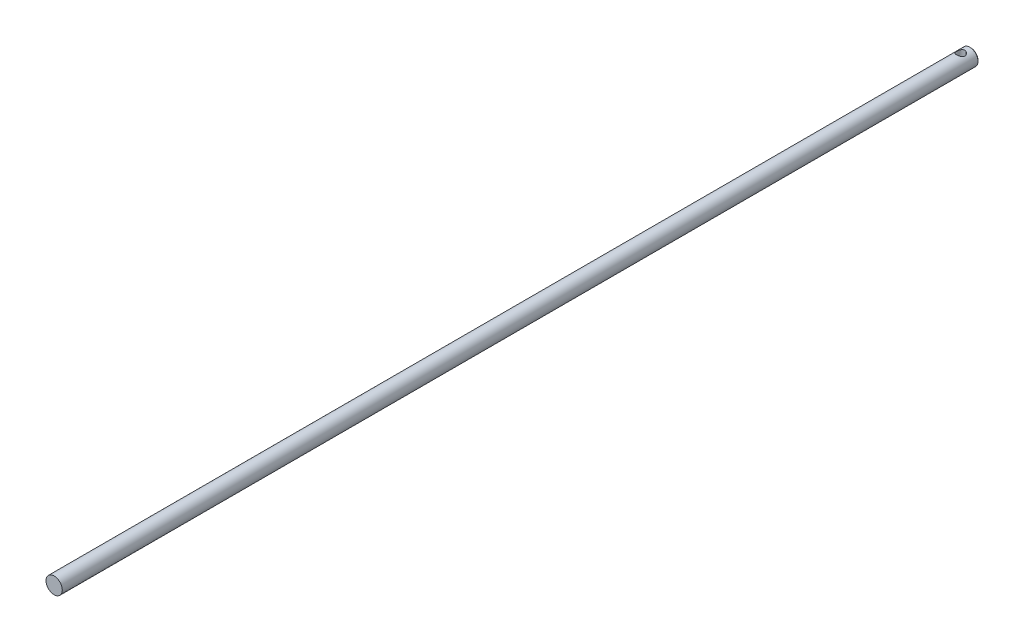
from build123d import *

# Parameters (mm, degrees)
ESQUISSE1_R                  = 4
BASE_EXTRUSION_DEPTH         = 450
ENL_V_MAT_EXTRU_1_DEPTH      = 450
ENL_V_MAT_EXTRU_1_DEPTH_BACK = 451.035554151
ESQUISSE2_R                  = 2
CHANFREIN1_SIZE              = 0.5


with BuildPart() as part:
    # Esquisse1 → Base-Extrusion (new body)
    with BuildSketch(Plane.XY):
        Circle(ESQUISSE1_R)
    extrude(amount=BASE_EXTRUSION_DEPTH)

    # Esquisse2 → Enl_v. mat.-Extru.1 (cut, two sides: drawn at the far end of the back side and taken through both)
    with BuildSketch(Plane(origin=(0, 0, 0), x_dir=(1, 0, 0), z_dir=(0, 1, 0)).offset(-ENL_V_MAT_EXTRU_1_DEPTH_BACK)):
        with Locations(Location((0, -5, 0), (0, 0, 270))):
            Circle(ESQUISSE2_R)
    extrude(amount=ENL_V_MAT_EXTRU_1_DEPTH + ENL_V_MAT_EXTRU_1_DEPTH_BACK, mode=Mode.SUBTRACT)

    # Chanfrein1
    chanfrein1_edges = [part.edges().sort_by_distance(p)[0] for p in [
        (-4, 0, 0),
    ]]
    chamfer(chanfrein1_edges, length=CHANFREIN1_SIZE)


solid = part.part
